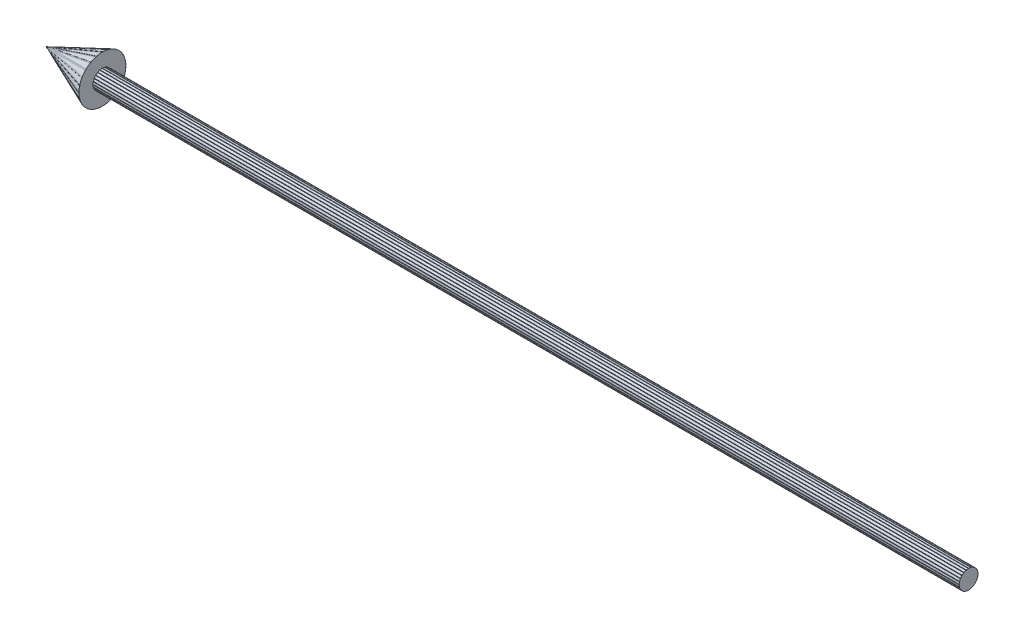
from build123d import *

# Parameters (mm, degrees)
ESQUISSE1_R                  = 1
BOSS_EXTRU_1_DEPTH           = 92.2
ENL_V_MAT_EXTRU_1_DEPTH      = 92.2
R_P_TITION_CIRCULAIRE1_COUNT = 24
ENL_V_MAT_EXTRU_2_DEPTH      = 0.05
R_P_TITION_CIRCULAIRE2_COUNT = 24


with BuildPart() as part:
    # Esquisse1 → Boss.-Extru.1 (new body)
    with BuildSketch(Plane(origin=(0, 0, 0), x_dir=(0, 0, -1), z_dir=(1, 0, 0))):
        Circle(ESQUISSE1_R)
    extrude(amount=BOSS_EXTRU_1_DEPTH)

    # Esquisse2 → R_volution1 (revolve)
    with BuildSketch(Plane.XY, mode=Mode.PRIVATE) as r_volution1_sk:
        Polygon((0, 0), (0, 2.5), (-6, 0), align=None)
    revolve(r_volution1_sk.sketch.rotate(Axis((0, 0, 0), (-1, 0, 0)), 90), axis=Axis((0, 0, 0), (-1, 0, 0)))

    # Esquisse3 → Enl_v. mat.-Extru.1 (cut)
    with BuildSketch(Plane(origin=(92.2, 0, 0), x_dir=(0, 0, -1), z_dir=(1, 0, 0))):
        Polygon((0, 0.98), (-0.05, 1.03), (0.05, 1.03), align=None)
    enl_v_mat_extru_1 = extrude(amount=-ENL_V_MAT_EXTRU_1_DEPTH, mode=Mode.SUBTRACT)

    # R_p_tition circulaire1: Enl_v. mat.-Extru.1 ×24 about axis
    r_p_tition_circulaire1_axis = Axis((0, 0, 0), (1, 0, 0))
    for i in range(1, R_P_TITION_CIRCULAIRE1_COUNT):
        add(enl_v_mat_extru_1.rotate(r_p_tition_circulaire1_axis, i * 360 / R_P_TITION_CIRCULAIRE1_COUNT), mode=Mode.SUBTRACT)

    # Esquisse4 → Enl_v. mat.-Extru.2 (cut, symmetric)
    with BuildSketch(Plane.XY):
        Polygon((0, 2.478333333), (-5.780470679, 0.069803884), (-5.832470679, 0.069803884), (0, 2.5), align=None)
    enl_v_mat_extru_2 = extrude(amount=ENL_V_MAT_EXTRU_2_DEPTH, both=True, mode=Mode.SUBTRACT)

    # R_p_tition circulaire2: Enl_v. mat.-Extru.2 ×24 about axis
    r_p_tition_circulaire2_axis = Axis((0, 0, 0), (1, 0, 0))
    for i in range(1, R_P_TITION_CIRCULAIRE2_COUNT):
        add(enl_v_mat_extru_2.rotate(r_p_tition_circulaire2_axis, i * 360 / R_P_TITION_CIRCULAIRE2_COUNT), mode=Mode.SUBTRACT)


solid = part.part
